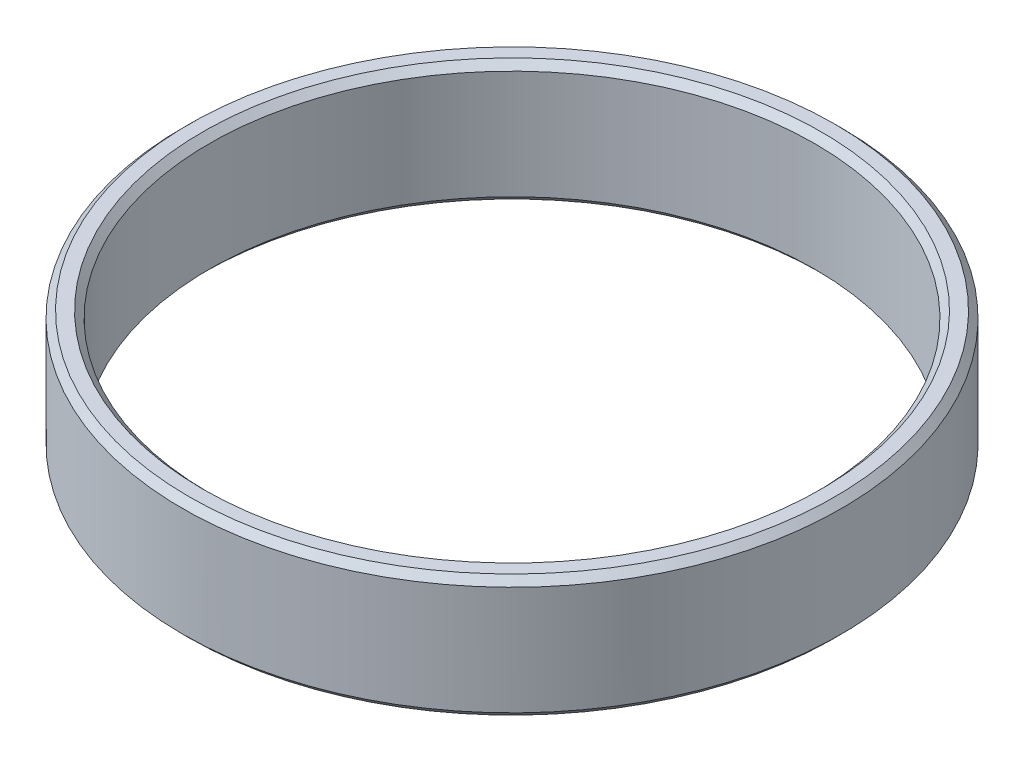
ISO-10303-21;
HEADER;
FILE_DESCRIPTION(('STEP AP214'),'2;1');
FILE_NAME('part.step','',(''),(''),'','','');
FILE_SCHEMA(('AUTOMOTIVE_DESIGN { 1 0 10303 214 1 1 1 1 }'));
ENDSEC;
DATA;
#1=APPLICATION_CONTEXT('core data for automotive mechanical design processes');
#2=APPLICATION_PROTOCOL_DEFINITION('international standard','automotive_design',2000,#1);
#3=PRODUCT_CONTEXT('',#1,'mechanical');
#4=PRODUCT('Part','Part','',(#3));
#5=PRODUCT_RELATED_PRODUCT_CATEGORY('part','',(#4));
#6=PRODUCT_DEFINITION_FORMATION('','',#4);
#7=PRODUCT_DEFINITION_CONTEXT('part definition',#1,'design');
#8=PRODUCT_DEFINITION('design','',#6,#7);
#9=PRODUCT_DEFINITION_SHAPE('','',#8);
#10=(LENGTH_UNIT() NAMED_UNIT(*) SI_UNIT(.MILLI.,.METRE.));
#11=(NAMED_UNIT(*) PLANE_ANGLE_UNIT() SI_UNIT($,.RADIAN.));
#12=(NAMED_UNIT(*) SI_UNIT($,.STERADIAN.) SOLID_ANGLE_UNIT());
#13=UNCERTAINTY_MEASURE_WITH_UNIT(LENGTH_MEASURE(1.E-05),#10,'distance_accuracy_value','');
#14=(GEOMETRIC_REPRESENTATION_CONTEXT(3) GLOBAL_UNCERTAINTY_ASSIGNED_CONTEXT((#13)) GLOBAL_UNIT_ASSIGNED_CONTEXT((#10,
#11,#12)) REPRESENTATION_CONTEXT('',''));
#15=CARTESIAN_POINT('',(0.,0.,0.));
#16=DIRECTION('',(0.,0.,1.));
#17=DIRECTION('',(1.,0.,0.));
#18=AXIS2_PLACEMENT_3D('',#15,#16,#17);
#19=CARTESIAN_POINT('',(0.,28.829,0.));
#20=DIRECTION('',(0.,1.,0.));
#21=DIRECTION('',(0.,0.,1.));
#22=AXIS2_PLACEMENT_3D('',#19,#20,#21);
#23=PLANE('',#22);
#24=CARTESIAN_POINT('',(0.,28.829,0.));
#25=DIRECTION('',(0.,1.,0.));
#26=DIRECTION('',(0.,0.,1.));
#27=AXIS2_PLACEMENT_3D('',#24,#25,#26);
#28=CIRCLE('',#27,76.14158);
#29=CARTESIAN_POINT('',(0.,28.829,76.14158));
#30=VERTEX_POINT('',#29);
#31=EDGE_CURVE('E10',#30,#30,#28,.T.);
#32=ORIENTED_EDGE('',*,*,#31,.T.);
#33=EDGE_LOOP('',(#32));
#34=FACE_BOUND('',#33,.T.);
#35=CARTESIAN_POINT('',(0.,28.829,0.));
#36=DIRECTION('',(0.,1.,0.));
#37=DIRECTION('',(0.,0.,1.));
#38=AXIS2_PLACEMENT_3D('',#35,#36,#37);
#39=CIRCLE('',#38,72.9665800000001);
#40=CARTESIAN_POINT('',(0.,28.829,72.9665800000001));
#41=VERTEX_POINT('',#40);
#42=EDGE_CURVE('E38',#41,#41,#39,.F.);
#43=ORIENTED_EDGE('',*,*,#42,.T.);
#44=EDGE_LOOP('',(#43));
#45=FACE_BOUND('',#44,.T.);
#46=ADVANCED_FACE('F31',(#34,#45),#23,.T.);
#47=CARTESIAN_POINT('',(0.,0.,0.));
#48=DIRECTION('',(0.,1.,0.));
#49=DIRECTION('',(0.,0.,1.));
#50=AXIS2_PLACEMENT_3D('',#47,#48,#49);
#51=PLANE('',#50);
#52=CARTESIAN_POINT('',(0.,0.,0.));
#53=DIRECTION('',(0.,1.,0.));
#54=DIRECTION('',(0.,0.,1.));
#55=AXIS2_PLACEMENT_3D('',#52,#53,#54);
#56=CIRCLE('',#55,76.1415799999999);
#57=CARTESIAN_POINT('',(0.,0.,76.1415799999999));
#58=VERTEX_POINT('',#57);
#59=EDGE_CURVE('E51',#58,#58,#56,.F.);
#60=ORIENTED_EDGE('',*,*,#59,.T.);
#61=EDGE_LOOP('',(#60));
#62=FACE_BOUND('',#61,.T.);
#63=CARTESIAN_POINT('',(0.,0.,0.));
#64=DIRECTION('',(0.,1.,0.));
#65=DIRECTION('',(0.,0.,1.));
#66=AXIS2_PLACEMENT_3D('',#63,#64,#65);
#67=CIRCLE('',#66,72.9665799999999);
#68=CARTESIAN_POINT('',(0.,0.,72.9665799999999));
#69=VERTEX_POINT('',#68);
#70=EDGE_CURVE('E54',#69,#69,#67,.T.);
#71=ORIENTED_EDGE('',*,*,#70,.T.);
#72=EDGE_LOOP('',(#71));
#73=FACE_BOUND('',#72,.T.);
#74=ADVANCED_FACE('F79',(#62,#73),#51,.F.);
#75=CARTESIAN_POINT('',(0.,28.829,0.));
#76=DIRECTION('',(0.,-1.,0.));
#77=DIRECTION('',(0.,0.,-1.));
#78=AXIS2_PLACEMENT_3D('',#75,#76,#77);
#79=CYLINDRICAL_SURFACE('',#78,77.72908);
#80=CARTESIAN_POINT('',(0.,1.58750000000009,0.));
#81=DIRECTION('',(0.,1.,0.));
#82=DIRECTION('',(0.,0.,1.));
#83=AXIS2_PLACEMENT_3D('',#80,#81,#82);
#84=CIRCLE('',#83,77.72908);
#85=CARTESIAN_POINT('',(0.,1.58750000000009,-77.72908));
#86=VERTEX_POINT('',#85);
#87=EDGE_CURVE('E57',#86,#86,#84,.T.);
#88=CARTESIAN_POINT('',(0.,27.2415000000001,0.));
#89=DIRECTION('',(0.,1.,0.));
#90=DIRECTION('',(0.,0.,1.));
#91=AXIS2_PLACEMENT_3D('',#88,#89,#90);
#92=CIRCLE('',#91,77.72908);
#93=CARTESIAN_POINT('',(0.,27.2415000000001,-77.72908));
#94=VERTEX_POINT('',#93);
#95=EDGE_CURVE('E60',#94,#94,#92,.F.);
#96=CARTESIAN_POINT('',(0.,1.58750000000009,-77.72908));
#97=CARTESIAN_POINT('',(0.,1.85472916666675,-77.72908));
#98=CARTESIAN_POINT('',(0.,2.12195833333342,-77.72908));
#99=CARTESIAN_POINT('',(0.,2.65641666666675,-77.72908));
#100=CARTESIAN_POINT('',(0.,2.92364583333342,-77.72908));
#101=CARTESIAN_POINT('',(0.,3.45810416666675,-77.72908));
#102=CARTESIAN_POINT('',(0.,3.72533333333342,-77.72908));
#103=CARTESIAN_POINT('',(0.,4.25979166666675,-77.72908));
#104=CARTESIAN_POINT('',(0.,4.52702083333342,-77.72908));
#105=CARTESIAN_POINT('',(0.,5.06147916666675,-77.72908));
#106=CARTESIAN_POINT('',(0.,5.32870833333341,-77.72908));
#107=CARTESIAN_POINT('',(0.,5.86316666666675,-77.72908));
#108=CARTESIAN_POINT('',(0.,6.13039583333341,-77.72908));
#109=CARTESIAN_POINT('',(0.,6.66485416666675,-77.72908));
#110=CARTESIAN_POINT('',(0.,6.93208333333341,-77.72908));
#111=CARTESIAN_POINT('',(0.,7.46654166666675,-77.72908));
#112=CARTESIAN_POINT('',(0.,7.73377083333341,-77.72908));
#113=CARTESIAN_POINT('',(0.,8.26822916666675,-77.72908));
#114=CARTESIAN_POINT('',(0.,8.53545833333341,-77.72908));
#115=CARTESIAN_POINT('',(0.,9.06991666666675,-77.72908));
#116=CARTESIAN_POINT('',(0.,9.33714583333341,-77.72908));
#117=CARTESIAN_POINT('',(0.,9.87160416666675,-77.72908));
#118=CARTESIAN_POINT('',(0.,10.1388333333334,-77.72908));
#119=CARTESIAN_POINT('',(0.,10.6732916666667,-77.72908));
#120=CARTESIAN_POINT('',(0.,10.9405208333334,-77.72908));
#121=CARTESIAN_POINT('',(0.,11.4749791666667,-77.72908));
#122=CARTESIAN_POINT('',(0.,11.7422083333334,-77.72908));
#123=CARTESIAN_POINT('',(0.,12.2766666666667,-77.72908));
#124=CARTESIAN_POINT('',(0.,12.5438958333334,-77.72908));
#125=CARTESIAN_POINT('',(0.,13.0783541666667,-77.72908));
#126=CARTESIAN_POINT('',(0.,13.3455833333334,-77.72908));
#127=CARTESIAN_POINT('',(0.,13.8800416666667,-77.72908));
#128=CARTESIAN_POINT('',(0.,14.1472708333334,-77.72908));
#129=CARTESIAN_POINT('',(0.,14.6817291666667,-77.72908));
#130=CARTESIAN_POINT('',(0.,14.9489583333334,-77.72908));
#131=CARTESIAN_POINT('',(0.,15.4834166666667,-77.72908));
#132=CARTESIAN_POINT('',(0.,15.7506458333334,-77.72908));
#133=CARTESIAN_POINT('',(0.,16.2851041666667,-77.72908));
#134=CARTESIAN_POINT('',(0.,16.5523333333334,-77.72908));
#135=CARTESIAN_POINT('',(0.,17.0867916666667,-77.72908));
#136=CARTESIAN_POINT('',(0.,17.3540208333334,-77.72908));
#137=CARTESIAN_POINT('',(0.,17.8884791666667,-77.72908));
#138=CARTESIAN_POINT('',(0.,18.1557083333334,-77.72908));
#139=CARTESIAN_POINT('',(0.,18.6901666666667,-77.72908));
#140=CARTESIAN_POINT('',(0.,18.9573958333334,-77.72908));
#141=CARTESIAN_POINT('',(0.,19.4918541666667,-77.72908));
#142=CARTESIAN_POINT('',(0.,19.7590833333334,-77.72908));
#143=CARTESIAN_POINT('',(0.,20.2935416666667,-77.72908));
#144=CARTESIAN_POINT('',(0.,20.5607708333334,-77.72908));
#145=CARTESIAN_POINT('',(0.,21.0952291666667,-77.72908));
#146=CARTESIAN_POINT('',(0.,21.3624583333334,-77.72908));
#147=CARTESIAN_POINT('',(0.,21.8969166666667,-77.72908));
#148=CARTESIAN_POINT('',(0.,22.1641458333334,-77.72908));
#149=CARTESIAN_POINT('',(0.,22.6986041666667,-77.72908));
#150=CARTESIAN_POINT('',(0.,22.9658333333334,-77.72908));
#151=CARTESIAN_POINT('',(0.,23.5002916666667,-77.72908));
#152=CARTESIAN_POINT('',(0.,23.7675208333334,-77.72908));
#153=CARTESIAN_POINT('',(0.,24.3019791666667,-77.72908));
#154=CARTESIAN_POINT('',(0.,24.5692083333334,-77.72908));
#155=CARTESIAN_POINT('',(0.,25.1036666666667,-77.72908));
#156=CARTESIAN_POINT('',(0.,25.3708958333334,-77.72908));
#157=CARTESIAN_POINT('',(0.,25.9053541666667,-77.72908));
#158=CARTESIAN_POINT('',(0.,26.1725833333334,-77.72908));
#159=CARTESIAN_POINT('',(0.,26.7070416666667,-77.72908));
#160=CARTESIAN_POINT('',(0.,26.9742708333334,-77.72908));
#161=CARTESIAN_POINT('',(0.,27.2415000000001,-77.72908));
#162=B_SPLINE_CURVE_WITH_KNOTS('',3,(#96,#97,#98,#99,#100,#101,#102,#103,#104,#105,#106,#107,
#108,#109,#110,#111,#112,#113,#114,#115,#116,#117,#118,#119,#120,#121,#122,#123,#124,#125,#126,
#127,#128,#129,#130,#131,#132,#133,#134,#135,#136,#137,#138,#139,#140,#141,#142,#143,#144,#145,
#146,#147,#148,#149,#150,#151,#152,#153,#154,#155,#156,#157,#158,#159,#160,#161),.UNSPECIFIED.,
.F.,.F.,(4,2,2,2,2,2,2,2,2,2,2,2,2,2,2,2,2,2,2,2,2,2,2,2,2,2,2,2,2,2,2,2,4),(0.,
0.801687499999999,1.603375,2.4050625,3.20675,4.0084375,4.81012499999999,5.61181249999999,6.4135,
7.21518749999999,8.01687499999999,8.8185625,9.62024999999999,10.4219375,11.223625,12.0253125,
12.827,13.6286875,14.430375,15.2320625,16.03375,16.8354375,17.637125,18.4388125,19.2405,
20.0421875,20.843875,21.6455625,22.44725,23.2489375,24.050625,24.8523125,25.654),.UNSPECIFIED.);
#163=EDGE_CURVE('BSEAM64',#86,#94,#162,.T.);
#164=ORIENTED_EDGE('',*,*,#87,.T.);
#165=ORIENTED_EDGE('',*,*,#95,.T.);
#166=ORIENTED_EDGE('',*,*,#163,.T.);
#167=ORIENTED_EDGE('',*,*,#163,.F.);
#168=EDGE_LOOP('',(#164,#166,#165,#167));
#169=FACE_BOUND('',#168,.T.);
#170=ADVANCED_FACE('F64',(#169),#79,.T.);
#171=CARTESIAN_POINT('',(0.,28.829,0.));
#172=DIRECTION('',(0.,-1.,0.));
#173=DIRECTION('',(0.,0.,-1.));
#174=AXIS2_PLACEMENT_3D('',#171,#172,#173);
#175=CYLINDRICAL_SURFACE('',#174,71.37908);
#176=CARTESIAN_POINT('',(0.,1.58749999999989,0.));
#177=DIRECTION('',(0.,1.,0.));
#178=DIRECTION('',(0.,0.,1.));
#179=AXIS2_PLACEMENT_3D('',#176,#177,#178);
#180=CIRCLE('',#179,71.37908);
#181=CARTESIAN_POINT('',(0.,1.58749999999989,-71.37908));
#182=VERTEX_POINT('',#181);
#183=EDGE_CURVE('E42',#182,#182,#180,.F.);
#184=CARTESIAN_POINT('',(0.,27.2414999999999,0.));
#185=DIRECTION('',(0.,1.,0.));
#186=DIRECTION('',(0.,0.,1.));
#187=AXIS2_PLACEMENT_3D('',#184,#185,#186);
#188=CIRCLE('',#187,71.37908);
#189=CARTESIAN_POINT('',(0.,27.2414999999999,-71.37908));
#190=VERTEX_POINT('',#189);
#191=EDGE_CURVE('E46',#190,#190,#188,.T.);
#192=CARTESIAN_POINT('',(0.,1.58749999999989,-71.37908));
#193=CARTESIAN_POINT('',(0.,1.85472916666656,-71.37908));
#194=CARTESIAN_POINT('',(0.,2.12195833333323,-71.37908));
#195=CARTESIAN_POINT('',(0.,2.65641666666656,-71.37908));
#196=CARTESIAN_POINT('',(0.,2.92364583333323,-71.37908));
#197=CARTESIAN_POINT('',(0.,3.45810416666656,-71.37908));
#198=CARTESIAN_POINT('',(0.,3.72533333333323,-71.37908));
#199=CARTESIAN_POINT('',(0.,4.25979166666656,-71.37908));
#200=CARTESIAN_POINT('',(0.,4.52702083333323,-71.37908));
#201=CARTESIAN_POINT('',(0.,5.06147916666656,-71.37908));
#202=CARTESIAN_POINT('',(0.,5.32870833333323,-71.37908));
#203=CARTESIAN_POINT('',(0.,5.86316666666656,-71.37908));
#204=CARTESIAN_POINT('',(0.,6.13039583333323,-71.37908));
#205=CARTESIAN_POINT('',(0.,6.66485416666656,-71.37908));
#206=CARTESIAN_POINT('',(0.,6.93208333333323,-71.37908));
#207=CARTESIAN_POINT('',(0.,7.46654166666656,-71.37908));
#208=CARTESIAN_POINT('',(0.,7.73377083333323,-71.37908));
#209=CARTESIAN_POINT('',(0.,8.26822916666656,-71.37908));
#210=CARTESIAN_POINT('',(0.,8.53545833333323,-71.37908));
#211=CARTESIAN_POINT('',(0.,9.06991666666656,-71.37908));
#212=CARTESIAN_POINT('',(0.,9.33714583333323,-71.37908));
#213=CARTESIAN_POINT('',(0.,9.87160416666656,-71.37908));
#214=CARTESIAN_POINT('',(0.,10.1388333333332,-71.37908));
#215=CARTESIAN_POINT('',(0.,10.6732916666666,-71.37908));
#216=CARTESIAN_POINT('',(0.,10.9405208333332,-71.37908));
#217=CARTESIAN_POINT('',(0.,11.4749791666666,-71.37908));
#218=CARTESIAN_POINT('',(0.,11.7422083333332,-71.37908));
#219=CARTESIAN_POINT('',(0.,12.2766666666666,-71.37908));
#220=CARTESIAN_POINT('',(0.,12.5438958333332,-71.37908));
#221=CARTESIAN_POINT('',(0.,13.0783541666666,-71.37908));
#222=CARTESIAN_POINT('',(0.,13.3455833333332,-71.37908));
#223=CARTESIAN_POINT('',(0.,13.8800416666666,-71.37908));
#224=CARTESIAN_POINT('',(0.,14.1472708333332,-71.37908));
#225=CARTESIAN_POINT('',(0.,14.6817291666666,-71.37908));
#226=CARTESIAN_POINT('',(0.,14.9489583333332,-71.37908));
#227=CARTESIAN_POINT('',(0.,15.4834166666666,-71.37908));
#228=CARTESIAN_POINT('',(0.,15.7506458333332,-71.37908));
#229=CARTESIAN_POINT('',(0.,16.2851041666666,-71.37908));
#230=CARTESIAN_POINT('',(0.,16.5523333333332,-71.37908));
#231=CARTESIAN_POINT('',(0.,17.0867916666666,-71.37908));
#232=CARTESIAN_POINT('',(0.,17.3540208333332,-71.37908));
#233=CARTESIAN_POINT('',(0.,17.8884791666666,-71.37908));
#234=CARTESIAN_POINT('',(0.,18.1557083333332,-71.37908));
#235=CARTESIAN_POINT('',(0.,18.6901666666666,-71.37908));
#236=CARTESIAN_POINT('',(0.,18.9573958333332,-71.37908));
#237=CARTESIAN_POINT('',(0.,19.4918541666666,-71.37908));
#238=CARTESIAN_POINT('',(0.,19.7590833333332,-71.37908));
#239=CARTESIAN_POINT('',(0.,20.2935416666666,-71.37908));
#240=CARTESIAN_POINT('',(0.,20.5607708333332,-71.37908));
#241=CARTESIAN_POINT('',(0.,21.0952291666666,-71.37908));
#242=CARTESIAN_POINT('',(0.,21.3624583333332,-71.37908));
#243=CARTESIAN_POINT('',(0.,21.8969166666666,-71.37908));
#244=CARTESIAN_POINT('',(0.,22.1641458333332,-71.37908));
#245=CARTESIAN_POINT('',(0.,22.6986041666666,-71.37908));
#246=CARTESIAN_POINT('',(0.,22.9658333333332,-71.37908));
#247=CARTESIAN_POINT('',(0.,23.5002916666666,-71.37908));
#248=CARTESIAN_POINT('',(0.,23.7675208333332,-71.37908));
#249=CARTESIAN_POINT('',(0.,24.3019791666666,-71.37908));
#250=CARTESIAN_POINT('',(0.,24.5692083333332,-71.37908));
#251=CARTESIAN_POINT('',(0.,25.1036666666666,-71.37908));
#252=CARTESIAN_POINT('',(0.,25.3708958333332,-71.37908));
#253=CARTESIAN_POINT('',(0.,25.9053541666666,-71.37908));
#254=CARTESIAN_POINT('',(0.,26.1725833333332,-71.37908));
#255=CARTESIAN_POINT('',(0.,26.7070416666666,-71.37908));
#256=CARTESIAN_POINT('',(0.,26.9742708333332,-71.37908));
#257=CARTESIAN_POINT('',(0.,27.2414999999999,-71.37908));
#258=B_SPLINE_CURVE_WITH_KNOTS('',3,(#192,#193,#194,#195,#196,#197,#198,#199,#200,#201,#202,
#203,#204,#205,#206,#207,#208,#209,#210,#211,#212,#213,#214,#215,#216,#217,#218,#219,#220,#221,
#222,#223,#224,#225,#226,#227,#228,#229,#230,#231,#232,#233,#234,#235,#236,#237,#238,#239,#240,
#241,#242,#243,#244,#245,#246,#247,#248,#249,#250,#251,#252,#253,#254,#255,#256,#257),
.UNSPECIFIED.,.F.,.F.,(4,2,2,2,2,2,2,2,2,2,2,2,2,2,2,2,2,2,2,2,2,2,2,2,2,2,2,2,2,2,2,2,4),(0.,
0.801687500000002,1.603375,2.4050625,3.20675,4.0084375,4.81012500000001,5.6118125,
6.41350000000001,7.2151875,8.01687500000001,8.81856250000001,9.62025000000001,10.4219375,
11.223625,12.0253125,12.827,13.6286875,14.430375,15.2320625,16.03375,16.8354375,17.637125,
18.4388125,19.2405,20.0421875,20.843875,21.6455625,22.44725,23.2489375,24.050625,24.8523125,
25.654),.UNSPECIFIED.);
#259=EDGE_CURVE('BSEAM87',#182,#190,#258,.T.);
#260=ORIENTED_EDGE('',*,*,#183,.T.);
#261=ORIENTED_EDGE('',*,*,#191,.T.);
#262=ORIENTED_EDGE('',*,*,#259,.T.);
#263=ORIENTED_EDGE('',*,*,#259,.F.);
#264=EDGE_LOOP('',(#260,#262,#261,#263));
#265=FACE_BOUND('',#264,.T.);
#266=ADVANCED_FACE('F87',(#265),#175,.F.);
#267=CARTESIAN_POINT('',(0.,1.58750000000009,0.));
#268=DIRECTION('',(0.,1.,0.));
#269=DIRECTION('',(0.,0.,1.));
#270=AXIS2_PLACEMENT_3D('',#267,#268,#269);
#271=CONICAL_SURFACE('',#270,77.72908,0.785398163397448);
#272=ORIENTED_EDGE('',*,*,#59,.F.);
#273=EDGE_LOOP('',(#272));
#274=FACE_BOUND('',#273,.T.);
#275=ORIENTED_EDGE('',*,*,#87,.F.);
#276=EDGE_LOOP('',(#275));
#277=FACE_BOUND('',#276,.T.);
#278=ADVANCED_FACE('F75',(#274,#277),#271,.T.);
#279=CARTESIAN_POINT('',(0.,0.,0.));
#280=DIRECTION('',(0.,-1.,0.));
#281=DIRECTION('',(0.,0.,-1.));
#282=AXIS2_PLACEMENT_3D('',#279,#280,#281);
#283=CONICAL_SURFACE('',#282,72.9665799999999,0.785398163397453);
#284=ORIENTED_EDGE('',*,*,#183,.F.);
#285=EDGE_LOOP('',(#284));
#286=FACE_BOUND('',#285,.T.);
#287=ORIENTED_EDGE('',*,*,#70,.F.);
#288=EDGE_LOOP('',(#287));
#289=FACE_BOUND('',#288,.T.);
#290=ADVANCED_FACE('F69',(#286,#289),#283,.F.);
#291=CARTESIAN_POINT('',(0.,28.829,0.));
#292=DIRECTION('',(0.,-1.,0.));
#293=DIRECTION('',(0.,0.,-1.));
#294=AXIS2_PLACEMENT_3D('',#291,#292,#293);
#295=CONICAL_SURFACE('',#294,76.14158,0.785398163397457);
#296=ORIENTED_EDGE('',*,*,#95,.F.);
#297=EDGE_LOOP('',(#296));
#298=FACE_BOUND('',#297,.T.);
#299=ORIENTED_EDGE('',*,*,#31,.F.);
#300=EDGE_LOOP('',(#299));
#301=FACE_BOUND('',#300,.T.);
#302=ADVANCED_FACE('F66',(#298,#301),#295,.T.);
#303=CARTESIAN_POINT('',(0.,27.2414999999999,0.));
#304=DIRECTION('',(0.,1.,0.));
#305=DIRECTION('',(0.,0.,1.));
#306=AXIS2_PLACEMENT_3D('',#303,#304,#305);
#307=CONICAL_SURFACE('',#306,71.37908,0.785398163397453);
#308=ORIENTED_EDGE('',*,*,#42,.F.);
#309=EDGE_LOOP('',(#308));
#310=FACE_BOUND('',#309,.T.);
#311=ORIENTED_EDGE('',*,*,#191,.F.);
#312=EDGE_LOOP('',(#311));
#313=FACE_BOUND('',#312,.T.);
#314=ADVANCED_FACE('F33',(#310,#313),#307,.F.);
#315=CLOSED_SHELL('',(#46,#74,#170,#266,#278,#290,#302,#314));
#316=MANIFOLD_SOLID_BREP('B2',#315);
#317=ADVANCED_BREP_SHAPE_REPRESENTATION('',(#18,#316),#14);
#318=SHAPE_DEFINITION_REPRESENTATION(#9,#317);
ENDSEC;
END-ISO-10303-21;
